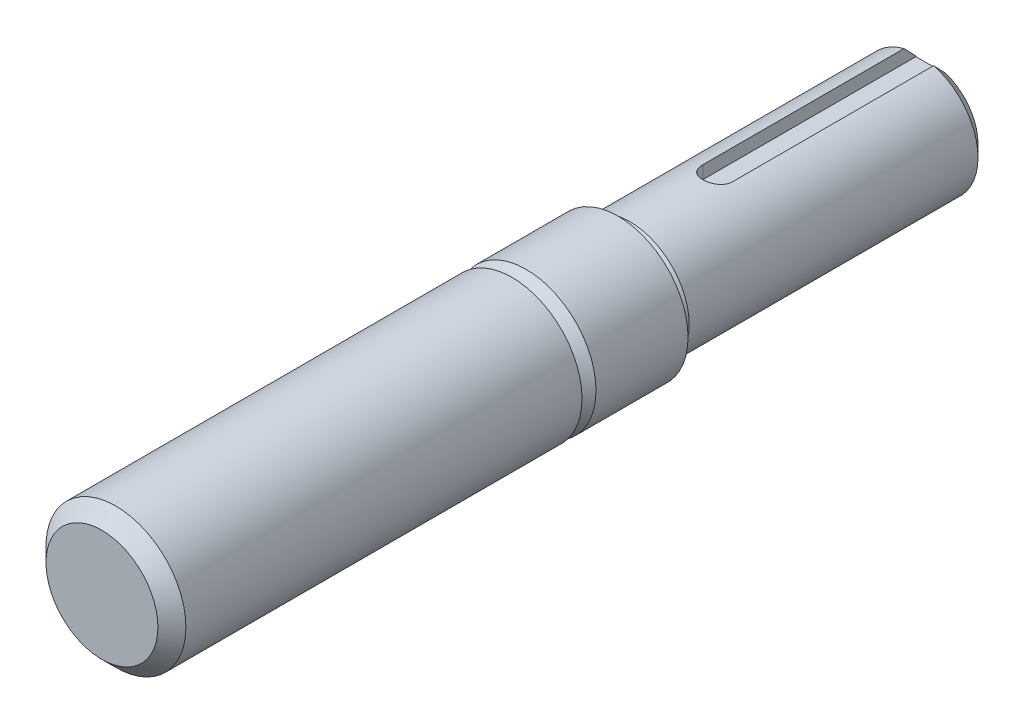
ISO-10303-21;
HEADER;
FILE_DESCRIPTION(('STEP AP214'),'2;1');
FILE_NAME('part.step','',(''),(''),'','','');
FILE_SCHEMA(('AUTOMOTIVE_DESIGN { 1 0 10303 214 1 1 1 1 }'));
ENDSEC;
DATA;
#1=APPLICATION_CONTEXT('core data for automotive mechanical design processes');
#2=APPLICATION_PROTOCOL_DEFINITION('international standard','automotive_design',2000,#1);
#3=PRODUCT_CONTEXT('',#1,'mechanical');
#4=PRODUCT('Part','Part','',(#3));
#5=PRODUCT_RELATED_PRODUCT_CATEGORY('part','',(#4));
#6=PRODUCT_DEFINITION_FORMATION('','',#4);
#7=PRODUCT_DEFINITION_CONTEXT('part definition',#1,'design');
#8=PRODUCT_DEFINITION('design','',#6,#7);
#9=PRODUCT_DEFINITION_SHAPE('','',#8);
#10=(LENGTH_UNIT() NAMED_UNIT(*) SI_UNIT(.MILLI.,.METRE.));
#11=(NAMED_UNIT(*) PLANE_ANGLE_UNIT() SI_UNIT($,.RADIAN.));
#12=(NAMED_UNIT(*) SI_UNIT($,.STERADIAN.) SOLID_ANGLE_UNIT());
#13=UNCERTAINTY_MEASURE_WITH_UNIT(LENGTH_MEASURE(1.E-05),#10,'distance_accuracy_value','');
#14=(GEOMETRIC_REPRESENTATION_CONTEXT(3) GLOBAL_UNCERTAINTY_ASSIGNED_CONTEXT((#13)) GLOBAL_UNIT_ASSIGNED_CONTEXT((#10,
#11,#12)) REPRESENTATION_CONTEXT('',''));
#15=CARTESIAN_POINT('',(0.,0.,0.));
#16=DIRECTION('',(0.,0.,1.));
#17=DIRECTION('',(1.,0.,0.));
#18=AXIS2_PLACEMENT_3D('',#15,#16,#17);
#19=CARTESIAN_POINT('',(0.,0.,0.));
#20=DIRECTION('',(0.,0.,-1.));
#21=DIRECTION('',(-1.,0.,0.));
#22=AXIS2_PLACEMENT_3D('',#19,#20,#21);
#23=PLANE('',#22);
#24=CARTESIAN_POINT('',(0.,0.,0.));
#25=DIRECTION('',(0.,0.,1.));
#26=DIRECTION('',(1.,0.,0.));
#27=AXIS2_PLACEMENT_3D('',#24,#25,#26);
#28=CIRCLE('',#27,6.002528);
#29=CARTESIAN_POINT('',(6.002528,0.,0.));
#30=VERTEX_POINT('',#29);
#31=EDGE_CURVE('E144',#30,#30,#28,.T.);
#32=ORIENTED_EDGE('',*,*,#31,.T.);
#33=EDGE_LOOP('',(#32));
#34=FACE_BOUND('',#33,.T.);
#35=ADVANCED_FACE('F31',(#34),#23,.F.);
#36=CARTESIAN_POINT('',(0.,0.,-1.500632));
#37=DIRECTION('',(0.,0.,-1.));
#38=DIRECTION('',(-1.,0.,0.));
#39=AXIS2_PLACEMENT_3D('',#36,#37,#38);
#40=CONICAL_SURFACE('',#39,7.50316,0.785398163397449);
#41=ORIENTED_EDGE('',*,*,#31,.F.);
#42=EDGE_LOOP('',(#41));
#43=FACE_BOUND('',#42,.T.);
#44=CARTESIAN_POINT('',(0.,0.,-1.500632));
#45=DIRECTION('',(0.,0.,1.));
#46=DIRECTION('',(1.,0.,0.));
#47=AXIS2_PLACEMENT_3D('',#44,#45,#46);
#48=CIRCLE('',#47,7.50316);
#49=CARTESIAN_POINT('',(7.50316,0.,-1.500632));
#50=VERTEX_POINT('',#49);
#51=EDGE_CURVE('E145',#50,#50,#48,.T.);
#52=ORIENTED_EDGE('',*,*,#51,.T.);
#53=EDGE_LOOP('',(#52));
#54=FACE_BOUND('',#53,.T.);
#55=ADVANCED_FACE('F135',(#43,#54),#40,.T.);
#56=CARTESIAN_POINT('',(0.,0.,0.));
#57=DIRECTION('',(0.,0.,1.));
#58=DIRECTION('',(1.,0.,0.));
#59=AXIS2_PLACEMENT_3D('',#56,#57,#58);
#60=CYLINDRICAL_SURFACE('',#59,7.50316);
#61=ORIENTED_EDGE('',*,*,#51,.F.);
#62=EDGE_LOOP('',(#61));
#63=FACE_BOUND('',#62,.T.);
#64=CARTESIAN_POINT('',(0.,0.,-43.9928));
#65=DIRECTION('',(0.,0.,1.));
#66=DIRECTION('',(1.,0.,0.));
#67=AXIS2_PLACEMENT_3D('',#64,#65,#66);
#68=CIRCLE('',#67,7.50316);
#69=CARTESIAN_POINT('',(7.50316,0.,-43.9928));
#70=VERTEX_POINT('',#69);
#71=EDGE_CURVE('E149',#70,#70,#68,.T.);
#72=ORIENTED_EDGE('',*,*,#71,.T.);
#73=EDGE_LOOP('',(#72));
#74=FACE_BOUND('',#73,.T.);
#75=ADVANCED_FACE('F140',(#63,#74),#60,.T.);
#76=CARTESIAN_POINT('',(0.,7.50316,-43.9928));
#77=DIRECTION('',(0.,0.,1.));
#78=DIRECTION('',(1.,0.,0.));
#79=AXIS2_PLACEMENT_3D('',#76,#77,#78);
#80=PLANE('',#79);
#81=ORIENTED_EDGE('',*,*,#71,.F.);
#82=EDGE_LOOP('',(#81));
#83=FACE_BOUND('',#82,.T.);
#84=CARTESIAN_POINT('',(0.,0.,-43.9928));
#85=DIRECTION('',(0.,0.,1.));
#86=DIRECTION('',(1.,0.,0.));
#87=AXIS2_PLACEMENT_3D('',#84,#85,#86);
#88=CIRCLE('',#87,6.002528);
#89=CARTESIAN_POINT('',(6.002528,0.,-43.9928));
#90=VERTEX_POINT('',#89);
#91=EDGE_CURVE('E278',#90,#90,#88,.T.);
#92=ORIENTED_EDGE('',*,*,#91,.T.);
#93=EDGE_LOOP('',(#92));
#94=FACE_BOUND('',#93,.T.);
#95=ADVANCED_FACE('F240',(#83,#94),#80,.F.);
#96=CARTESIAN_POINT('',(0.,0.,-45.493432));
#97=DIRECTION('',(0.,0.,-1.));
#98=DIRECTION('',(-1.,0.,0.));
#99=AXIS2_PLACEMENT_3D('',#96,#97,#98);
#100=CONICAL_SURFACE('',#99,7.50316,0.785398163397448);
#101=ORIENTED_EDGE('',*,*,#91,.F.);
#102=EDGE_LOOP('',(#101));
#103=FACE_BOUND('',#102,.T.);
#104=CARTESIAN_POINT('',(0.,0.,-45.493432));
#105=DIRECTION('',(0.,0.,1.));
#106=DIRECTION('',(1.,0.,0.));
#107=AXIS2_PLACEMENT_3D('',#104,#105,#106);
#108=CIRCLE('',#107,7.50316);
#109=CARTESIAN_POINT('',(7.50316,0.,-45.493432));
#110=VERTEX_POINT('',#109);
#111=EDGE_CURVE('E280',#110,#110,#108,.T.);
#112=ORIENTED_EDGE('',*,*,#111,.T.);
#113=EDGE_LOOP('',(#112));
#114=FACE_BOUND('',#113,.T.);
#115=ADVANCED_FACE('F230',(#103,#114),#100,.T.);
#116=CARTESIAN_POINT('',(0.,0.,0.));
#117=DIRECTION('',(0.,0.,1.));
#118=DIRECTION('',(1.,0.,0.));
#119=AXIS2_PLACEMENT_3D('',#116,#117,#118);
#120=CYLINDRICAL_SURFACE('',#119,7.50316);
#121=ORIENTED_EDGE('',*,*,#111,.F.);
#122=EDGE_LOOP('',(#121));
#123=FACE_BOUND('',#122,.T.);
#124=CARTESIAN_POINT('',(0.,0.,-55.372));
#125=DIRECTION('',(0.,0.,1.));
#126=DIRECTION('',(1.,0.,0.));
#127=AXIS2_PLACEMENT_3D('',#124,#125,#126);
#128=CIRCLE('',#127,7.50316);
#129=CARTESIAN_POINT('',(7.50316,0.,-55.372));
#130=VERTEX_POINT('',#129);
#131=EDGE_CURVE('E285',#130,#130,#128,.T.);
#132=ORIENTED_EDGE('',*,*,#131,.T.);
#133=EDGE_LOOP('',(#132));
#134=FACE_BOUND('',#133,.T.);
#135=ADVANCED_FACE('F220',(#123,#134),#120,.T.);
#136=CARTESIAN_POINT('',(0.,7.50316,-55.372));
#137=DIRECTION('',(0.,0.,1.));
#138=DIRECTION('',(1.,0.,0.));
#139=AXIS2_PLACEMENT_3D('',#136,#137,#138);
#140=PLANE('',#139);
#141=ORIENTED_EDGE('',*,*,#131,.F.);
#142=EDGE_LOOP('',(#141));
#143=FACE_BOUND('',#142,.T.);
#144=CARTESIAN_POINT('',(0.,0.,-55.372));
#145=DIRECTION('',(0.,0.,1.));
#146=DIRECTION('',(1.,0.,0.));
#147=AXIS2_PLACEMENT_3D('',#144,#145,#146);
#148=CIRCLE('',#147,5.715);
#149=CARTESIAN_POINT('',(5.715,0.,-55.372));
#150=VERTEX_POINT('',#149);
#151=EDGE_CURVE('E288',#150,#150,#148,.T.);
#152=ORIENTED_EDGE('',*,*,#151,.T.);
#153=EDGE_LOOP('',(#152));
#154=FACE_BOUND('',#153,.T.);
#155=ADVANCED_FACE('F210',(#143,#154),#140,.F.);
#156=CARTESIAN_POINT('',(0.,0.,-56.642));
#157=DIRECTION('',(0.,0.,-1.));
#158=DIRECTION('',(-1.,0.,0.));
#159=AXIS2_PLACEMENT_3D('',#156,#157,#158);
#160=CONICAL_SURFACE('',#159,6.35,0.463647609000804);
#161=ORIENTED_EDGE('',*,*,#151,.F.);
#162=EDGE_LOOP('',(#161));
#163=FACE_BOUND('',#162,.T.);
#164=CARTESIAN_POINT('',(0.,0.,-56.642));
#165=DIRECTION('',(0.,0.,1.));
#166=DIRECTION('',(1.,0.,0.));
#167=AXIS2_PLACEMENT_3D('',#164,#165,#166);
#168=CIRCLE('',#167,6.35);
#169=CARTESIAN_POINT('',(6.35,0.,-56.642));
#170=VERTEX_POINT('',#169);
#171=EDGE_CURVE('E291',#170,#170,#168,.T.);
#172=ORIENTED_EDGE('',*,*,#171,.T.);
#173=EDGE_LOOP('',(#172));
#174=FACE_BOUND('',#173,.T.);
#175=ADVANCED_FACE('F201',(#163,#174),#160,.T.);
#176=CARTESIAN_POINT('',(0.,0.,0.));
#177=DIRECTION('',(0.,0.,1.));
#178=DIRECTION('',(1.,0.,0.));
#179=AXIS2_PLACEMENT_3D('',#176,#177,#178);
#180=CYLINDRICAL_SURFACE('',#179,6.35);
#181=ORIENTED_EDGE('',*,*,#171,.F.);
#182=EDGE_LOOP('',(#181));
#183=FACE_BOUND('',#182,.T.);
#184=CARTESIAN_POINT('',(1.5901005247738,6.14768902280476,-66.04));
#185=CARTESIAN_POINT('',(1.5901010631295,6.14768606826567,-65.9960878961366));
#186=CARTESIAN_POINT('',(1.58827737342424,6.14816087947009,-65.9521975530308));
#187=CARTESIAN_POINT('',(1.58100740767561,6.15003549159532,-65.8647451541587));
#188=CARTESIAN_POINT('',(1.57556174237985,6.15143513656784,-65.8211830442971));
#189=CARTESIAN_POINT('',(1.55387113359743,6.15696519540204,-65.6916415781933));
#190=CARTESIAN_POINT('',(1.53227222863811,6.16242707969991,-65.6065524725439));
#191=CARTESIAN_POINT('',(1.47549651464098,6.1762652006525,-65.4413563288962));
#192=CARTESIAN_POINT('',(1.4403210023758,6.18464115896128,-65.3612488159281));
#193=CARTESIAN_POINT('',(1.35743301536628,6.20335998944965,-65.2080318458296));
#194=CARTESIAN_POINT('',(1.30971716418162,6.21370339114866,-65.1349242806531));
#195=CARTESIAN_POINT('',(1.20199107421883,6.23544607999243,-64.9962171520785));
#196=CARTESIAN_POINT('',(1.14175660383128,6.24686218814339,-64.9307944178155));
#197=CARTESIAN_POINT('',(1.01118061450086,6.26932178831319,-64.8108612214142));
#198=CARTESIAN_POINT('',(0.940837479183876,6.2803652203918,-64.7563525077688));
#199=CARTESIAN_POINT('',(0.790820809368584,6.30102422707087,-64.6590702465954));
#200=CARTESIAN_POINT('',(0.711030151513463,6.31061757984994,-64.616472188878));
#201=CARTESIAN_POINT('',(0.545144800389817,6.32710470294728,-64.5453624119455));
#202=CARTESIAN_POINT('',(0.459051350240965,6.33399900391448,-64.516847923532));
#203=CARTESIAN_POINT('',(0.284848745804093,6.34419550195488,-64.4752803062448));
#204=CARTESIAN_POINT('',(0.196815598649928,6.34756754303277,-64.4619260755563));
#205=CARTESIAN_POINT('',(0.0196960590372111,6.35058675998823,-64.4501135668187));
#206=CARTESIAN_POINT('',(-0.0693901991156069,6.3502344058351,-64.4516534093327));
#207=CARTESIAN_POINT('',(-0.243986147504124,6.34589881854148,-64.4693693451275));
#208=CARTESIAN_POINT('',(-0.329531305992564,6.34199661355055,-64.4852187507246));
#209=CARTESIAN_POINT('',(-0.496707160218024,6.33109811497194,-64.5305793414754));
#210=CARTESIAN_POINT('',(-0.578337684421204,6.32410168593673,-64.5600911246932));
#211=CARTESIAN_POINT('',(-0.736218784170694,6.30768131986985,-64.6321994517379));
#212=CARTESIAN_POINT('',(-0.812414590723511,6.29823619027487,-64.6749108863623));
#213=CARTESIAN_POINT('',(-0.956669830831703,6.27794527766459,-64.7721181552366));
#214=CARTESIAN_POINT('',(-1.0247280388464,6.26709928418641,-64.8266157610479));
#215=CARTESIAN_POINT('',(-1.15271011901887,6.24484566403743,-64.9475836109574));
#216=CARTESIAN_POINT('',(-1.21236561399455,6.23343077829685,-65.014336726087));
#217=CARTESIAN_POINT('',(-1.31970986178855,6.21159207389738,-65.1570373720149));
#218=CARTESIAN_POINT('',(-1.367395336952,6.20116852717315,-65.2329874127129));
#219=CARTESIAN_POINT('',(-1.44962450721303,6.18246580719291,-65.3924698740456));
#220=CARTESIAN_POINT('',(-1.48409532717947,6.17419860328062,-65.4760412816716));
#221=CARTESIAN_POINT('',(-1.53837060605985,6.16090170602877,-65.6479996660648));
#222=CARTESIAN_POINT('',(-1.55819696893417,6.15586717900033,-65.7363792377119));
#223=CARTESIAN_POINT('',(-1.575215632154,6.15152115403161,-65.8612700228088));
#224=CARTESIAN_POINT('',(-1.57884770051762,6.15058913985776,-65.8969425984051));
#225=CARTESIAN_POINT('',(-1.58368689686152,6.14934480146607,-65.9684044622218));
#226=CARTESIAN_POINT('',(-1.58489794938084,6.14903147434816,-66.0041934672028));
#227=CARTESIAN_POINT('',(-1.5848994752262,6.14903192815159,-66.04));
#228=B_SPLINE_CURVE_WITH_KNOTS('',3,(#184,#185,#186,#187,#188,#189,#190,#191,#192,#193,#194,
#195,#196,#197,#198,#199,#200,#201,#202,#203,#204,#205,#206,#207,#208,#209,#210,#211,#212,#213,
#214,#215,#216,#217,#218,#219,#220,#221,#222,#223,#224,#225,#226,#227),.UNSPECIFIED.,.F.,.F.,(4,
2,2,2,2,2,2,2,2,2,2,2,2,2,2,2,2,2,2,2,2,4),(0.,0.131653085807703,0.263283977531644,
0.525791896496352,0.788274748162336,1.05082834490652,1.31856812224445,1.58635075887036,
1.85789272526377,2.12938127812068,2.39537784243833,2.66134084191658,2.92138130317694,
3.18143314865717,3.44381548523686,3.70623728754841,3.97572526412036,4.24528695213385,
4.51631451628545,4.78693587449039,4.89447326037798,5.00183618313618),.UNSPECIFIED.);
#229=CARTESIAN_POINT('',(1.5901005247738,6.14768902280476,-66.04));
#230=VERTEX_POINT('',#229);
#231=CARTESIAN_POINT('',(-1.5848994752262,6.14903192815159,-66.04));
#232=VERTEX_POINT('',#231);
#233=EDGE_CURVE('E11',#230,#232,#228,.T.);
#234=ORIENTED_EDGE('',*,*,#233,.T.);
#235=DIRECTION('',(0.,0.,1.));
#236=VECTOR('',#235,1.);
#237=CARTESIAN_POINT('',(-1.58489947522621,6.14903192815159,0.));
#238=LINE('',#237,#236);
#239=CARTESIAN_POINT('',(-1.5848994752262,6.14903192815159,-87.63));
#240=VERTEX_POINT('',#239);
#241=EDGE_CURVE('E158',#232,#240,#238,.F.);
#242=ORIENTED_EDGE('',*,*,#241,.T.);
#243=CARTESIAN_POINT('',(0.,0.,-87.63));
#244=DIRECTION('',(0.,0.,1.));
#245=DIRECTION('',(1.,0.,0.));
#246=AXIS2_PLACEMENT_3D('',#243,#244,#245);
#247=CIRCLE('',#246,6.35);
#248=CARTESIAN_POINT('',(1.5901005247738,6.14768902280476,-87.63));
#249=VERTEX_POINT('',#248);
#250=EDGE_CURVE('E157',#240,#249,#247,.T.);
#251=ORIENTED_EDGE('',*,*,#250,.T.);
#252=DIRECTION('',(0.,0.,1.));
#253=VECTOR('',#252,1.);
#254=CARTESIAN_POINT('',(1.59010052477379,6.14768902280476,0.));
#255=LINE('',#254,#253);
#256=EDGE_CURVE('E114',#249,#230,#255,.T.);
#257=ORIENTED_EDGE('',*,*,#256,.T.);
#258=EDGE_LOOP('',(#234,#242,#251,#257));
#259=FACE_BOUND('',#258,.T.);
#260=ADVANCED_FACE('F131',(#183,#259),#180,.T.);
#261=CARTESIAN_POINT('',(0.,0.,-88.9));
#262=DIRECTION('',(0.,0.,1.));
#263=DIRECTION('',(1.,0.,0.));
#264=AXIS2_PLACEMENT_3D('',#261,#262,#263);
#265=CONICAL_SURFACE('',#264,5.08,0.785398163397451);
#266=ORIENTED_EDGE('',*,*,#250,.F.);
#267=CARTESIAN_POINT('',(-1.5848994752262,7.80037352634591,-86.0202428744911));
#268=CARTESIAN_POINT('',(-1.5848994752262,7.57276601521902,-86.243273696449));
#269=CARTESIAN_POINT('',(-1.5848994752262,7.34498276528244,-86.4661259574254));
#270=CARTESIAN_POINT('',(-1.5848994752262,6.88891382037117,-86.9113009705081));
#271=CARTESIAN_POINT('',(-1.5848994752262,6.6606281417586,-87.133623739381));
#272=CARTESIAN_POINT('',(-1.5848994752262,6.20345497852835,-87.5775174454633));
#273=CARTESIAN_POINT('',(-1.5848994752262,5.97456768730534,-87.7990885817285));
#274=CARTESIAN_POINT('',(-1.5848994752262,5.51586069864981,-88.2412818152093));
#275=CARTESIAN_POINT('',(-1.5848994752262,5.28604096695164,-88.461903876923));
#276=CARTESIAN_POINT('',(-1.5848994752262,4.82497908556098,-88.9018537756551));
#277=CARTESIAN_POINT('',(-1.5848994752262,4.59373637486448,-89.1211810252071));
#278=CARTESIAN_POINT('',(-1.5848994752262,4.1292905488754,-89.5577186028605));
#279=CARTESIAN_POINT('',(-1.5848994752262,3.89608760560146,-89.7749291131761));
#280=CARTESIAN_POINT('',(-1.5848994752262,3.54383830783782,-90.098175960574));
#281=CARTESIAN_POINT('',(-1.5848994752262,3.42599105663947,-90.2055175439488));
#282=CARTESIAN_POINT('',(-1.5848994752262,3.18924292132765,-90.4190243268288));
#283=CARTESIAN_POINT('',(-1.5848994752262,3.07034208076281,-90.5251895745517));
#284=CARTESIAN_POINT('',(-1.5848994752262,2.83109644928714,-90.7359596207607));
#285=CARTESIAN_POINT('',(-1.5848994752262,2.71075123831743,-90.8405639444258));
#286=CARTESIAN_POINT('',(-1.5848994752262,2.52877211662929,-90.9957754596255));
#287=CARTESIAN_POINT('',(-1.5848994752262,2.46786456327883,-91.047233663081));
#288=CARTESIAN_POINT('',(-1.5848994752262,2.34546471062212,-91.1494544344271));
#289=CARTESIAN_POINT('',(-1.5848994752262,2.2839723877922,-91.2002169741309));
#290=CARTESIAN_POINT('',(-1.5848994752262,2.2221399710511,-91.2505655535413));
#291=B_SPLINE_CURVE_WITH_KNOTS('',3,(#267,#268,#269,#270,#271,#272,#273,#274,#275,#276,#277,
#278,#279,#280,#281,#282,#283,#284,#285,#286,#287,#288,#289,#290),.UNSPECIFIED.,.F.,.F.,(4,2,2,
2,2,2,2,2,2,2,2,4),(0.,0.955998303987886,1.91196592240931,2.86765673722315,3.82338299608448,
4.77951387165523,5.73556170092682,6.21377311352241,6.69196485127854,7.17029920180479,
7.40949971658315,7.64870989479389),.UNSPECIFIED.);
#292=CARTESIAN_POINT('',(-1.5848994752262,4.82643695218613,-88.9));
#293=VERTEX_POINT('',#292);
#294=EDGE_CURVE('E58',#240,#293,#291,.T.);
#295=ORIENTED_EDGE('',*,*,#294,.T.);
#296=CARTESIAN_POINT('',(0.,0.,-88.9));
#297=DIRECTION('',(0.,0.,1.));
#298=DIRECTION('',(1.,0.,0.));
#299=AXIS2_PLACEMENT_3D('',#296,#297,#298);
#300=CIRCLE('',#299,5.08);
#301=CARTESIAN_POINT('',(1.5901005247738,4.82472593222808,-88.9));
#302=VERTEX_POINT('',#301);
#303=EDGE_CURVE('E154',#293,#302,#300,.T.);
#304=ORIENTED_EDGE('',*,*,#303,.T.);
#305=CARTESIAN_POINT('',(1.5901005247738,2.22051194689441,-91.2488659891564));
#306=CARTESIAN_POINT('',(1.5901005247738,2.32412289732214,-91.1645621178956));
#307=CARTESIAN_POINT('',(1.5901005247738,2.42681009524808,-91.0791423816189));
#308=CARTESIAN_POINT('',(1.5901005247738,2.63070159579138,-90.9065707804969));
#309=CARTESIAN_POINT('',(1.5901005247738,2.73190605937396,-90.8194191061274));
#310=CARTESIAN_POINT('',(1.5901005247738,2.93319463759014,-90.6438859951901));
#311=CARTESIAN_POINT('',(1.5901005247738,3.03327901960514,-90.5555048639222));
#312=CARTESIAN_POINT('',(1.5901005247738,3.2325899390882,-90.3777752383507));
#313=CARTESIAN_POINT('',(1.5901005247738,3.3318164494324,-90.28842671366));
#314=CARTESIAN_POINT('',(1.5901005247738,3.6284122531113,-90.0193389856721));
#315=CARTESIAN_POINT('',(1.5901005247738,3.82477415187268,-89.8384904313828));
#316=CARTESIAN_POINT('',(1.5901005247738,4.21575408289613,-89.4749048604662));
#317=CARTESIAN_POINT('',(1.5901005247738,4.41037202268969,-89.2921677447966));
#318=CARTESIAN_POINT('',(1.5901005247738,4.67961230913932,-89.0376730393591));
#319=CARTESIAN_POINT('',(1.5901005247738,4.75475343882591,-88.9664634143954));
#320=CARTESIAN_POINT('',(1.5901005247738,4.90487531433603,-88.8238705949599));
#321=CARTESIAN_POINT('',(1.5901005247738,4.97985605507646,-88.7524873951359));
#322=CARTESIAN_POINT('',(1.5901005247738,5.28533114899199,-88.461093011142));
#323=CARTESIAN_POINT('',(1.5901005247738,5.51522736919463,-88.2404547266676));
#324=CARTESIAN_POINT('',(1.5901005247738,5.97409169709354,-87.7982143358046));
#325=CARTESIAN_POINT('',(1.5901005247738,6.20305980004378,-87.5766122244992));
#326=CARTESIAN_POINT('',(1.5901005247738,6.66028572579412,-87.1327524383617));
#327=CARTESIAN_POINT('',(1.5901005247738,6.88854365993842,-86.910494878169));
#328=CARTESIAN_POINT('',(1.5901005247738,7.34454372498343,-86.4654571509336));
#329=CARTESIAN_POINT('',(1.5901005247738,7.57228586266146,-86.2426769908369));
#330=CARTESIAN_POINT('',(1.5901005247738,7.79985131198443,-86.0197173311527));
#331=B_SPLINE_CURVE_WITH_KNOTS('',3,(#305,#306,#307,#308,#309,#310,#311,#312,#313,#314,#315,
#316,#317,#318,#319,#320,#321,#322,#323,#324,#325,#326,#327,#328,#329,#330),.UNSPECIFIED.,.F.,
.F.,(4,2,2,2,2,2,2,2,2,2,2,2,4),(0.,0.400700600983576,0.801357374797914,1.20191637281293,
1.60248798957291,2.40332617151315,3.20420656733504,3.51477520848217,3.82535355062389,
4.78127843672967,5.73720820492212,6.69297966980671,7.64873850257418),.UNSPECIFIED.);
#332=EDGE_CURVE('E105',#302,#249,#331,.T.);
#333=ORIENTED_EDGE('',*,*,#332,.T.);
#334=EDGE_LOOP('',(#266,#295,#304,#333));
#335=FACE_BOUND('',#334,.T.);
#336=ADVANCED_FACE('F116',(#335),#265,.T.);
#337=CARTESIAN_POINT('',(0.,5.08,-88.9));
#338=DIRECTION('',(0.,0.,1.));
#339=DIRECTION('',(1.,0.,0.));
#340=AXIS2_PLACEMENT_3D('',#337,#338,#339);
#341=PLANE('',#340);
#342=ORIENTED_EDGE('',*,*,#303,.F.);
#343=DIRECTION('',(0.,-1.,0.));
#344=VECTOR('',#343,1.);
#345=CARTESIAN_POINT('',(-1.5848994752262,5.08,-88.9));
#346=LINE('',#345,#344);
#347=CARTESIAN_POINT('',(-1.5848994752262,4.7625,-88.9));
#348=VERTEX_POINT('',#347);
#349=EDGE_CURVE('E43',#293,#348,#346,.T.);
#350=ORIENTED_EDGE('',*,*,#349,.T.);
#351=DIRECTION('',(1.,0.,0.));
#352=VECTOR('',#351,1.);
#353=CARTESIAN_POINT('',(-1.5848994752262,4.7625,-88.9));
#354=LINE('',#353,#352);
#355=CARTESIAN_POINT('',(1.5901005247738,4.7625,-88.9));
#356=VERTEX_POINT('',#355);
#357=EDGE_CURVE('E100',#348,#356,#354,.T.);
#358=ORIENTED_EDGE('',*,*,#357,.T.);
#359=DIRECTION('',(0.,1.,0.));
#360=VECTOR('',#359,1.);
#361=CARTESIAN_POINT('',(1.5901005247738,5.08,-88.9));
#362=LINE('',#361,#360);
#363=EDGE_CURVE('E98',#356,#302,#362,.T.);
#364=ORIENTED_EDGE('',*,*,#363,.T.);
#365=EDGE_LOOP('',(#342,#350,#358,#364));
#366=FACE_BOUND('',#365,.T.);
#367=ADVANCED_FACE('F124',(#366),#341,.F.);
#368=CARTESIAN_POINT('',(0.00260052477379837,7.50316000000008,-66.04));
#369=DIRECTION('',(0.,-1.,0.));
#370=DIRECTION('',(0.,0.,-1.));
#371=AXIS2_PLACEMENT_3D('',#368,#369,#370);
#372=CYLINDRICAL_SURFACE('',#371,1.5875);
#373=DIRECTION('',(0.,-1.,0.));
#374=VECTOR('',#373,1.);
#375=CARTESIAN_POINT('',(1.5901005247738,7.50316000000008,-66.04));
#376=LINE('',#375,#374);
#377=CARTESIAN_POINT('',(1.5901005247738,4.76250000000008,-66.04));
#378=VERTEX_POINT('',#377);
#379=EDGE_CURVE('E83',#230,#378,#376,.T.);
#380=ORIENTED_EDGE('',*,*,#379,.T.);
#381=CARTESIAN_POINT('',(0.00260052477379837,4.76250000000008,-66.04));
#382=DIRECTION('',(0.,-1.,0.));
#383=DIRECTION('',(0.,0.,-1.));
#384=AXIS2_PLACEMENT_3D('',#381,#382,#383);
#385=CIRCLE('',#384,1.5875);
#386=CARTESIAN_POINT('',(-1.5848994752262,4.76250000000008,-66.04));
#387=VERTEX_POINT('',#386);
#388=EDGE_CURVE('E86',#378,#387,#385,.T.);
#389=ORIENTED_EDGE('',*,*,#388,.T.);
#390=DIRECTION('',(0.,-1.,0.));
#391=VECTOR('',#390,1.);
#392=CARTESIAN_POINT('',(-1.5848994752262,7.50316000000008,-66.04));
#393=LINE('',#392,#391);
#394=EDGE_CURVE('E90',#232,#387,#393,.T.);
#395=ORIENTED_EDGE('',*,*,#394,.F.);
#396=ORIENTED_EDGE('',*,*,#233,.F.);
#397=EDGE_LOOP('',(#380,#389,#395,#396));
#398=FACE_BOUND('',#397,.T.);
#399=ADVANCED_FACE('F84',(#398),#372,.F.);
#400=CARTESIAN_POINT('',(-1.5848994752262,7.50316000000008,-66.04));
#401=DIRECTION('',(-1.,0.,0.));
#402=DIRECTION('',(0.,0.,1.));
#403=AXIS2_PLACEMENT_3D('',#400,#401,#402);
#404=PLANE('',#403);
#405=ORIENTED_EDGE('',*,*,#394,.T.);
#406=DIRECTION('',(0.,0.,-1.));
#407=VECTOR('',#406,1.);
#408=CARTESIAN_POINT('',(-1.5848994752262,4.76250000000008,-66.04));
#409=LINE('',#408,#407);
#410=EDGE_CURVE('E91',#387,#348,#409,.T.);
#411=ORIENTED_EDGE('',*,*,#410,.T.);
#412=ORIENTED_EDGE('',*,*,#349,.F.);
#413=ORIENTED_EDGE('',*,*,#294,.F.);
#414=ORIENTED_EDGE('',*,*,#241,.F.);
#415=EDGE_LOOP('',(#405,#411,#412,#413,#414));
#416=FACE_BOUND('',#415,.T.);
#417=ADVANCED_FACE('F121',(#416),#404,.F.);
#418=CARTESIAN_POINT('',(1.5901005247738,7.50316,-88.9));
#419=DIRECTION('',(1.,0.,0.));
#420=DIRECTION('',(0.,0.,-1.));
#421=AXIS2_PLACEMENT_3D('',#418,#419,#420);
#422=PLANE('',#421);
#423=ORIENTED_EDGE('',*,*,#332,.F.);
#424=ORIENTED_EDGE('',*,*,#363,.F.);
#425=DIRECTION('',(0.,0.,1.));
#426=VECTOR('',#425,1.);
#427=CARTESIAN_POINT('',(1.5901005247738,4.7625,-88.9));
#428=LINE('',#427,#426);
#429=EDGE_CURVE('E50',#356,#378,#428,.T.);
#430=ORIENTED_EDGE('',*,*,#429,.T.);
#431=ORIENTED_EDGE('',*,*,#379,.F.);
#432=ORIENTED_EDGE('',*,*,#256,.F.);
#433=EDGE_LOOP('',(#423,#424,#430,#431,#432));
#434=FACE_BOUND('',#433,.T.);
#435=ADVANCED_FACE('F96',(#434),#422,.F.);
#436=CARTESIAN_POINT('',(0.00260052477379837,4.76250000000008,-66.04));
#437=DIRECTION('',(0.,-1.,0.));
#438=DIRECTION('',(0.,0.,-1.));
#439=AXIS2_PLACEMENT_3D('',#436,#437,#438);
#440=PLANE('',#439);
#441=ORIENTED_EDGE('',*,*,#357,.F.);
#442=ORIENTED_EDGE('',*,*,#410,.F.);
#443=ORIENTED_EDGE('',*,*,#388,.F.);
#444=ORIENTED_EDGE('',*,*,#429,.F.);
#445=EDGE_LOOP('',(#441,#442,#443,#444));
#446=FACE_BOUND('',#445,.T.);
#447=ADVANCED_FACE('F93',(#446),#440,.F.);
#448=CLOSED_SHELL('',(#35,#55,#75,#95,#115,#135,#155,#175,#260,#336,#367,#399,#417,#435,#447));
#449=MANIFOLD_SOLID_BREP('B2',#448);
#450=ADVANCED_BREP_SHAPE_REPRESENTATION('',(#18,#449),#14);
#451=SHAPE_DEFINITION_REPRESENTATION(#9,#450);
ENDSEC;
END-ISO-10303-21;
